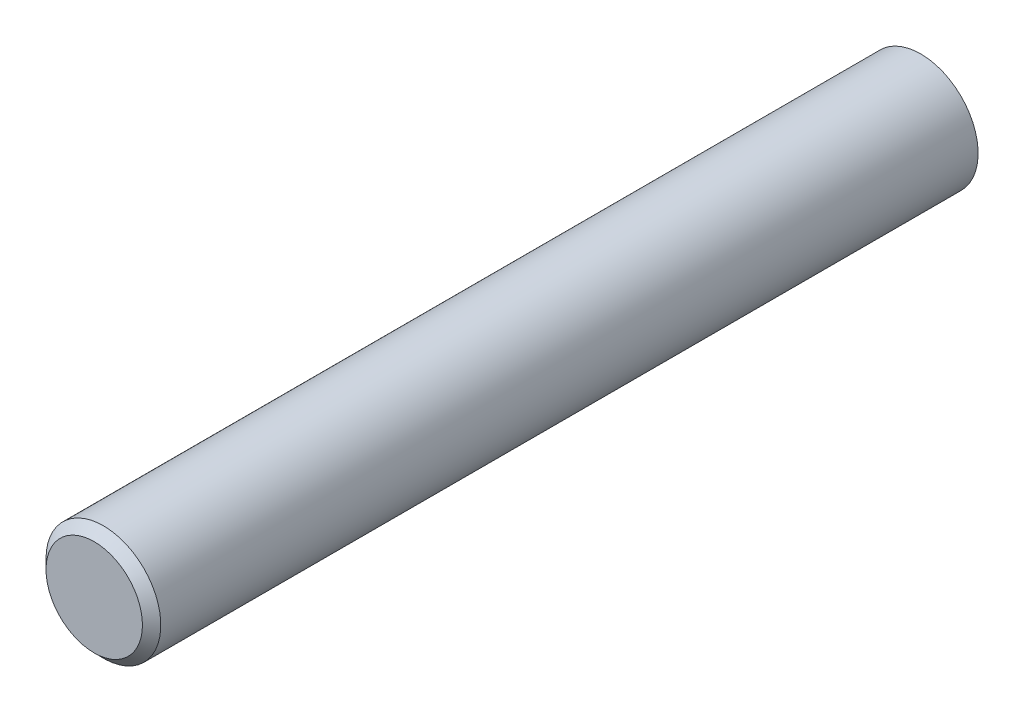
from build123d import *

# Parameters (mm, degrees)
SKETCH_1_R          = 12.5
EXTRUDE_1_DEPTH     = 180
CHAMFER_1_SIZE      = 2
SKETCH_2_R          = 4
CUT_EXTRUDE_1_DEPTH = 15


with BuildPart() as part:
    # Sketch 1 → Extrude 1 (new body)
    with BuildSketch(Plane.XY):
        with Locations(Location((0, 0, 0), (0, 0, 180))):
            Circle(SKETCH_1_R)
    extrude(amount=EXTRUDE_1_DEPTH)

    # Chamfer 1
    chamfer_1_edges = [part.edges().sort_by_distance(p)[0] for p in [
        (12.5, 0, 180),
    ]]
    chamfer(chamfer_1_edges, length=CHAMFER_1_SIZE)

    # Sketch 2 → Cut-Extrude 1 (cut)
    with BuildSketch(Plane(origin=(0, 0, 0), x_dir=(-1, 0, 0), z_dir=(0, 0, -1))):
        Circle(SKETCH_2_R)
    extrude(amount=-CUT_EXTRUDE_1_DEPTH, mode=Mode.SUBTRACT)


solid = part.part
